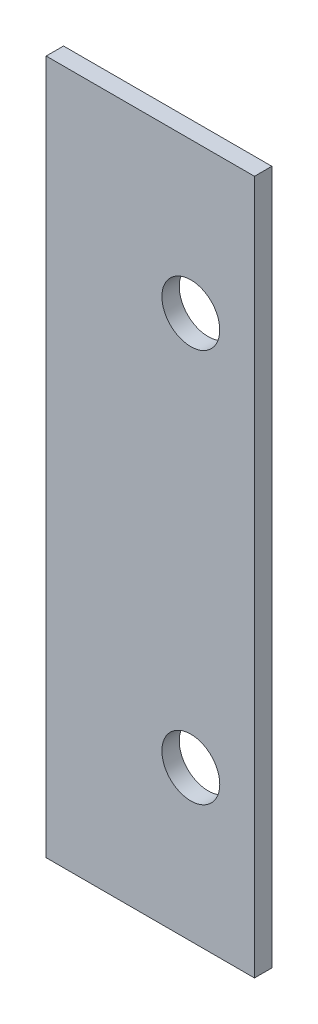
ISO-10303-21;
HEADER;
FILE_DESCRIPTION(('STEP AP214'),'2;1');
FILE_NAME('part.step','',(''),(''),'','','');
FILE_SCHEMA(('AUTOMOTIVE_DESIGN { 1 0 10303 214 1 1 1 1 }'));
ENDSEC;
DATA;
#1=APPLICATION_CONTEXT('core data for automotive mechanical design processes');
#2=APPLICATION_PROTOCOL_DEFINITION('international standard','automotive_design',2000,#1);
#3=PRODUCT_CONTEXT('',#1,'mechanical');
#4=PRODUCT('Part','Part','',(#3));
#5=PRODUCT_RELATED_PRODUCT_CATEGORY('part','',(#4));
#6=PRODUCT_DEFINITION_FORMATION('','',#4);
#7=PRODUCT_DEFINITION_CONTEXT('part definition',#1,'design');
#8=PRODUCT_DEFINITION('design','',#6,#7);
#9=PRODUCT_DEFINITION_SHAPE('','',#8);
#10=(LENGTH_UNIT() NAMED_UNIT(*) SI_UNIT(.MILLI.,.METRE.));
#11=(NAMED_UNIT(*) PLANE_ANGLE_UNIT() SI_UNIT($,.RADIAN.));
#12=(NAMED_UNIT(*) SI_UNIT($,.STERADIAN.) SOLID_ANGLE_UNIT());
#13=UNCERTAINTY_MEASURE_WITH_UNIT(LENGTH_MEASURE(1.E-05),#10,'distance_accuracy_value','');
#14=(GEOMETRIC_REPRESENTATION_CONTEXT(3) GLOBAL_UNCERTAINTY_ASSIGNED_CONTEXT((#13)) GLOBAL_UNIT_ASSIGNED_CONTEXT((#10,
#11,#12)) REPRESENTATION_CONTEXT('',''));
#15=CARTESIAN_POINT('',(0.,0.,0.));
#16=DIRECTION('',(0.,0.,1.));
#17=DIRECTION('',(1.,0.,0.));
#18=AXIS2_PLACEMENT_3D('',#15,#16,#17);
#19=CARTESIAN_POINT('',(-12.5,30.,1.5));
#20=DIRECTION('',(1.,0.,0.));
#21=DIRECTION('',(0.,0.,-1.));
#22=AXIS2_PLACEMENT_3D('',#19,#20,#21);
#23=PLANE('',#22);
#24=DIRECTION('',(0.,-1.,0.));
#25=VECTOR('',#24,1.);
#26=CARTESIAN_POINT('',(-12.5,30.,0.));
#27=LINE('',#26,#25);
#28=CARTESIAN_POINT('',(-12.5,30.,0.));
#29=VERTEX_POINT('',#28);
#30=CARTESIAN_POINT('',(-12.5,-30.,0.));
#31=VERTEX_POINT('',#30);
#32=EDGE_CURVE('E62',#29,#31,#27,.T.);
#33=ORIENTED_EDGE('',*,*,#32,.T.);
#34=DIRECTION('',(0.,0.,-1.));
#35=VECTOR('',#34,1.);
#36=CARTESIAN_POINT('',(-12.5,-30.,1.5));
#37=LINE('',#36,#35);
#38=CARTESIAN_POINT('',(-12.5,-30.,1.5));
#39=VERTEX_POINT('',#38);
#40=EDGE_CURVE('E11',#39,#31,#37,.T.);
#41=ORIENTED_EDGE('',*,*,#40,.F.);
#42=DIRECTION('',(0.,-1.,0.));
#43=VECTOR('',#42,1.);
#44=CARTESIAN_POINT('',(-12.5,30.,1.5));
#45=LINE('',#44,#43);
#46=CARTESIAN_POINT('',(-12.5,30.,1.5));
#47=VERTEX_POINT('',#46);
#48=EDGE_CURVE('E92',#47,#39,#45,.T.);
#49=ORIENTED_EDGE('',*,*,#48,.F.);
#50=DIRECTION('',(0.,0.,-1.));
#51=VECTOR('',#50,1.);
#52=CARTESIAN_POINT('',(-12.5,30.,1.5));
#53=LINE('',#52,#51);
#54=EDGE_CURVE('E75',#47,#29,#53,.T.);
#55=ORIENTED_EDGE('',*,*,#54,.T.);
#56=EDGE_LOOP('',(#33,#41,#49,#55));
#57=FACE_BOUND('',#56,.T.);
#58=ADVANCED_FACE('F17',(#57),#23,.F.);
#59=CARTESIAN_POINT('',(-12.5,-30.,1.5));
#60=DIRECTION('',(0.,1.,0.));
#61=DIRECTION('',(-1.,0.,0.));
#62=AXIS2_PLACEMENT_3D('',#59,#60,#61);
#63=PLANE('',#62);
#64=DIRECTION('',(1.,0.,0.));
#65=VECTOR('',#64,1.);
#66=CARTESIAN_POINT('',(-12.5,-30.,0.));
#67=LINE('',#66,#65);
#68=CARTESIAN_POINT('',(5.50000000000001,-30.,0.));
#69=VERTEX_POINT('',#68);
#70=EDGE_CURVE('E57',#31,#69,#67,.T.);
#71=ORIENTED_EDGE('',*,*,#70,.T.);
#72=DIRECTION('',(0.,0.,-1.));
#73=VECTOR('',#72,1.);
#74=CARTESIAN_POINT('',(5.50000000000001,-30.,1.5));
#75=LINE('',#74,#73);
#76=CARTESIAN_POINT('',(5.50000000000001,-30.,1.5));
#77=VERTEX_POINT('',#76);
#78=EDGE_CURVE('E24',#77,#69,#75,.T.);
#79=ORIENTED_EDGE('',*,*,#78,.F.);
#80=DIRECTION('',(1.,0.,0.));
#81=VECTOR('',#80,1.);
#82=CARTESIAN_POINT('',(-12.5,-30.,1.5));
#83=LINE('',#82,#81);
#84=EDGE_CURVE('E71',#39,#77,#83,.T.);
#85=ORIENTED_EDGE('',*,*,#84,.F.);
#86=ORIENTED_EDGE('',*,*,#40,.T.);
#87=EDGE_LOOP('',(#71,#79,#85,#86));
#88=FACE_BOUND('',#87,.T.);
#89=ADVANCED_FACE('F70',(#88),#63,.F.);
#90=CARTESIAN_POINT('',(5.50000000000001,-30.,1.5));
#91=DIRECTION('',(-1.,0.,0.));
#92=DIRECTION('',(0.,0.,1.));
#93=AXIS2_PLACEMENT_3D('',#90,#91,#92);
#94=PLANE('',#93);
#95=DIRECTION('',(0.,1.,0.));
#96=VECTOR('',#95,1.);
#97=CARTESIAN_POINT('',(5.50000000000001,-30.,0.));
#98=LINE('',#97,#96);
#99=CARTESIAN_POINT('',(5.50000000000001,30.,0.));
#100=VERTEX_POINT('',#99);
#101=EDGE_CURVE('E63',#69,#100,#98,.T.);
#102=ORIENTED_EDGE('',*,*,#101,.T.);
#103=DIRECTION('',(0.,0.,-1.));
#104=VECTOR('',#103,1.);
#105=CARTESIAN_POINT('',(5.50000000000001,30.,1.5));
#106=LINE('',#105,#104);
#107=CARTESIAN_POINT('',(5.50000000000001,30.,1.5));
#108=VERTEX_POINT('',#107);
#109=EDGE_CURVE('E104',#108,#100,#106,.T.);
#110=ORIENTED_EDGE('',*,*,#109,.F.);
#111=DIRECTION('',(0.,1.,0.));
#112=VECTOR('',#111,1.);
#113=CARTESIAN_POINT('',(5.50000000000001,-30.,1.5));
#114=LINE('',#113,#112);
#115=EDGE_CURVE('E36',#77,#108,#114,.T.);
#116=ORIENTED_EDGE('',*,*,#115,.F.);
#117=ORIENTED_EDGE('',*,*,#78,.T.);
#118=EDGE_LOOP('',(#102,#110,#116,#117));
#119=FACE_BOUND('',#118,.T.);
#120=ADVANCED_FACE('F107',(#119),#94,.F.);
#121=CARTESIAN_POINT('',(5.50000000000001,30.,1.5));
#122=DIRECTION('',(0.,-1.,0.));
#123=DIRECTION('',(1.,0.,0.));
#124=AXIS2_PLACEMENT_3D('',#121,#122,#123);
#125=PLANE('',#124);
#126=DIRECTION('',(-1.,0.,0.));
#127=VECTOR('',#126,1.);
#128=CARTESIAN_POINT('',(5.50000000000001,30.,0.));
#129=LINE('',#128,#127);
#130=EDGE_CURVE('E82',#100,#29,#129,.T.);
#131=ORIENTED_EDGE('',*,*,#130,.T.);
#132=ORIENTED_EDGE('',*,*,#54,.F.);
#133=DIRECTION('',(-1.,0.,0.));
#134=VECTOR('',#133,1.);
#135=CARTESIAN_POINT('',(5.50000000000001,30.,1.5));
#136=LINE('',#135,#134);
#137=EDGE_CURVE('E31',#108,#47,#136,.T.);
#138=ORIENTED_EDGE('',*,*,#137,.F.);
#139=ORIENTED_EDGE('',*,*,#109,.T.);
#140=EDGE_LOOP('',(#131,#132,#138,#139));
#141=FACE_BOUND('',#140,.T.);
#142=ADVANCED_FACE('F109',(#141),#125,.F.);
#143=CARTESIAN_POINT('',(0.,-17.,1.5));
#144=DIRECTION('',(0.,0.,-1.));
#145=DIRECTION('',(-1.,0.,0.));
#146=AXIS2_PLACEMENT_3D('',#143,#144,#145);
#147=CYLINDRICAL_SURFACE('',#146,2.5);
#148=CARTESIAN_POINT('',(0.,-17.,1.5));
#149=DIRECTION('',(0.,0.,1.));
#150=DIRECTION('',(1.,0.,0.));
#151=AXIS2_PLACEMENT_3D('',#148,#149,#150);
#152=CIRCLE('',#151,2.5);
#153=CARTESIAN_POINT('',(2.5,-17.,1.5));
#154=VERTEX_POINT('',#153);
#155=EDGE_CURVE('E100',#154,#154,#152,.T.);
#156=ORIENTED_EDGE('',*,*,#155,.T.);
#157=EDGE_LOOP('',(#156));
#158=FACE_BOUND('',#157,.T.);
#159=CARTESIAN_POINT('',(0.,-17.,0.));
#160=DIRECTION('',(0.,0.,1.));
#161=DIRECTION('',(1.,0.,0.));
#162=AXIS2_PLACEMENT_3D('',#159,#160,#161);
#163=CIRCLE('',#162,2.5);
#164=CARTESIAN_POINT('',(2.5,-17.,0.));
#165=VERTEX_POINT('',#164);
#166=EDGE_CURVE('E88',#165,#165,#163,.T.);
#167=ORIENTED_EDGE('',*,*,#166,.F.);
#168=EDGE_LOOP('',(#167));
#169=FACE_BOUND('',#168,.T.);
#170=ADVANCED_FACE('F120',(#158,#169),#147,.F.);
#171=CARTESIAN_POINT('',(0.,17.,1.5));
#172=DIRECTION('',(0.,0.,-1.));
#173=DIRECTION('',(-1.,0.,0.));
#174=AXIS2_PLACEMENT_3D('',#171,#172,#173);
#175=CYLINDRICAL_SURFACE('',#174,2.5);
#176=CARTESIAN_POINT('',(0.,17.,1.5));
#177=DIRECTION('',(0.,0.,-1.));
#178=DIRECTION('',(1.,0.,0.));
#179=AXIS2_PLACEMENT_3D('',#176,#177,#178);
#180=CIRCLE('',#179,2.5);
#181=CARTESIAN_POINT('',(2.5,17.,1.5));
#182=VERTEX_POINT('',#181);
#183=EDGE_CURVE('E96',#182,#182,#180,.T.);
#184=ORIENTED_EDGE('',*,*,#183,.F.);
#185=EDGE_LOOP('',(#184));
#186=FACE_BOUND('',#185,.T.);
#187=CARTESIAN_POINT('',(0.,17.,0.));
#188=DIRECTION('',(0.,0.,-1.));
#189=DIRECTION('',(1.,0.,0.));
#190=AXIS2_PLACEMENT_3D('',#187,#188,#189);
#191=CIRCLE('',#190,2.5);
#192=CARTESIAN_POINT('',(2.5,17.,0.));
#193=VERTEX_POINT('',#192);
#194=EDGE_CURVE('E84',#193,#193,#191,.T.);
#195=ORIENTED_EDGE('',*,*,#194,.T.);
#196=EDGE_LOOP('',(#195));
#197=FACE_BOUND('',#196,.T.);
#198=ADVANCED_FACE('F113',(#186,#197),#175,.F.);
#199=CARTESIAN_POINT('',(-12.5,-30.,1.5));
#200=DIRECTION('',(0.,0.,1.));
#201=DIRECTION('',(1.,0.,0.));
#202=AXIS2_PLACEMENT_3D('',#199,#200,#201);
#203=PLANE('',#202);
#204=ORIENTED_EDGE('',*,*,#155,.F.);
#205=EDGE_LOOP('',(#204));
#206=FACE_BOUND('',#205,.T.);
#207=ORIENTED_EDGE('',*,*,#48,.T.);
#208=ORIENTED_EDGE('',*,*,#84,.T.);
#209=ORIENTED_EDGE('',*,*,#115,.T.);
#210=ORIENTED_EDGE('',*,*,#137,.T.);
#211=EDGE_LOOP('',(#207,#208,#209,#210));
#212=FACE_BOUND('',#211,.T.);
#213=ORIENTED_EDGE('',*,*,#183,.T.);
#214=EDGE_LOOP('',(#213));
#215=FACE_BOUND('',#214,.T.);
#216=ADVANCED_FACE('F110',(#206,#212,#215),#203,.T.);
#217=CARTESIAN_POINT('',(-12.5,-30.,0.));
#218=DIRECTION('',(0.,0.,1.));
#219=DIRECTION('',(1.,0.,0.));
#220=AXIS2_PLACEMENT_3D('',#217,#218,#219);
#221=PLANE('',#220);
#222=ORIENTED_EDGE('',*,*,#166,.T.);
#223=EDGE_LOOP('',(#222));
#224=FACE_BOUND('',#223,.T.);
#225=ORIENTED_EDGE('',*,*,#32,.F.);
#226=ORIENTED_EDGE('',*,*,#130,.F.);
#227=ORIENTED_EDGE('',*,*,#101,.F.);
#228=ORIENTED_EDGE('',*,*,#70,.F.);
#229=EDGE_LOOP('',(#225,#226,#227,#228));
#230=FACE_BOUND('',#229,.T.);
#231=ORIENTED_EDGE('',*,*,#194,.F.);
#232=EDGE_LOOP('',(#231));
#233=FACE_BOUND('',#232,.T.);
#234=ADVANCED_FACE('F58',(#224,#230,#233),#221,.F.);
#235=CLOSED_SHELL('',(#58,#89,#120,#142,#170,#198,#216,#234));
#236=MANIFOLD_SOLID_BREP('B1',#235);
#237=ADVANCED_BREP_SHAPE_REPRESENTATION('',(#18,#236),#14);
#238=SHAPE_DEFINITION_REPRESENTATION(#9,#237);
ENDSEC;
END-ISO-10303-21;
